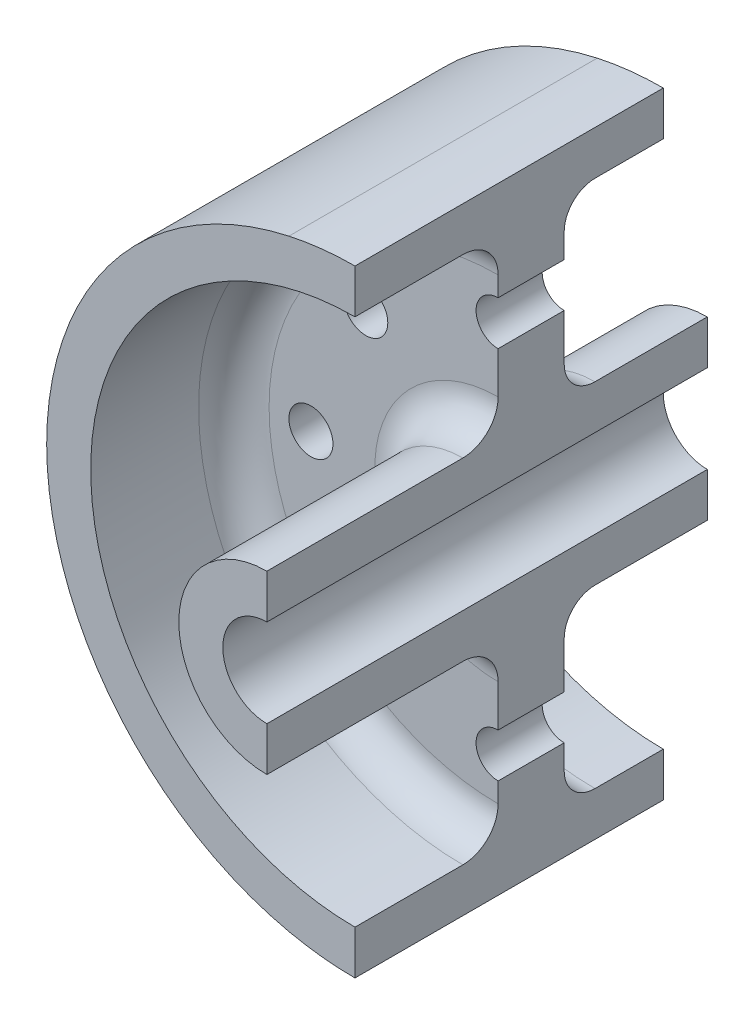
from build123d import *

# Parameters (mm, degrees)
SKETCH2_R         = 12.7
EXTRUDE1_DEPTH    = 358.409680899
CIRPATTERN1_COUNT = 8
FILLET1_R         = 20.32
FILLET4_R         = 20.32
FILLET2_R         = 17.78
FILLET3_R         = 17.78
SKETCH6_W         = 184.900743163
SKETCH6_H         = 385.344806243
EXTRUDE2_DEPTH    = 358.409680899


with BuildPart() as part:
    # Sketch1 → Revolve1 (revolve)
    with BuildSketch(Plane(origin=(0, 0, 0), x_dir=(0, 0, -1), z_dir=(1, 0, 0)), mode=Mode.PRIVATE) as revolve1_sk:
        Polygon((0, 25.4), (254, 25.4), (254, 50.8), (171.45, 50.8), (171.45, 152.4), (228.6, 152.4), (228.6, 177.8), (50.8, 177.8), (50.8, 152.4), (133.35, 152.4), (133.35, 50.8), (0, 50.8), align=None)
    revolve(revolve1_sk.sketch.rotate(Axis((0, 0, 0), (0, 0, -1)), 90), axis=Axis((0, 0, 0), (0, 0, -1)))

    # Sketch2 → Extrude1 (cut, through all)
    with BuildSketch(Plane.XY):
        with Locations((0, 107.95)):
            Circle(SKETCH2_R)
    extrude1 = extrude(amount=-EXTRUDE1_DEPTH, mode=Mode.SUBTRACT)

    # CirPattern1: Extrude1 ×8 about axis
    cirpattern1_axis = Axis((0, 0, 0), (0, 0, 1))
    for i in range(1, CIRPATTERN1_COUNT):
        add(extrude1.rotate(cirpattern1_axis, i * 360 / CIRPATTERN1_COUNT), mode=Mode.SUBTRACT)

    # Fillet1
    fillet1_edges = [part.edges().sort_by_distance(p)[0] for p in [
        (-152.4, 0, -133.35),
    ]]
    fillet(fillet1_edges, radius=FILLET1_R)

    # Fillet4
    fillet4_edges = [part.edges().sort_by_distance(p)[0] for p in [
        (-50.8, 0, -133.35),
    ]]
    fillet(fillet4_edges, radius=FILLET4_R)

    # Fillet2
    fillet2_edges = [part.edges().sort_by_distance(p)[0] for p in [
        (-152.4, 0, -171.45),
    ]]
    fillet(fillet2_edges, radius=FILLET2_R)

    # Fillet3
    fillet3_edges = [part.edges().sort_by_distance(p)[0] for p in [
        (-50.8, 0, -171.45),
    ]]
    fillet(fillet3_edges, radius=FILLET3_R)

    # Sketch6 → Extrude2 (cut, through all)
    with BuildSketch(Plane.XY):
        with Locations((92.450371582, -2.266734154)):
            Rectangle(SKETCH6_W, SKETCH6_H)
    extrude(amount=-EXTRUDE2_DEPTH, mode=Mode.SUBTRACT)


solid = part.part
